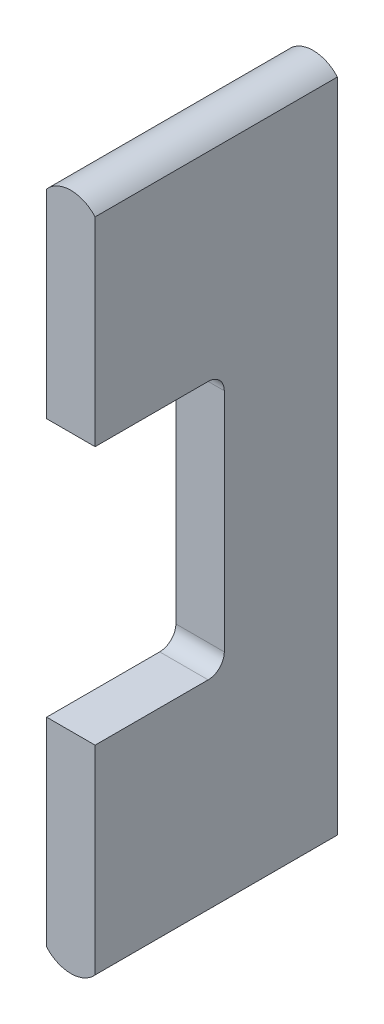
from build123d import *

# Parameters (mm, degrees)
BASE_EXTRUSION_DEPTH    = 15
ENL_V_MAT_EXTRU_1_DEPTH = 26.980762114


with BuildPart() as part:
    # Esquisse1 → Base-Extrusion (new body)
    with BuildSketch(Plane.XY):
        with BuildLine():
            Line((1.5, 20.322875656), (1.5, -20.322875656))
            ThreePointArc((1.5, -20.322875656), (0, -21), (-1.5, -20.322875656))
            Line((-1.5, -20.322875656), (-1.5, 20.322875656))
            ThreePointArc((-1.5, 20.322875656), (0, 21), (1.5, 20.322875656))
        make_face()
    extrude(amount=BASE_EXTRUSION_DEPTH)

    # Esquisse2 → Enl_v. mat.-Extru.1 (cut, through all)
    with BuildSketch(Plane(origin=(1.5, 0, 0), x_dir=(0, 0, -1), z_dir=(1, 0, 0))):
        with BuildLine():
            Line((-15, -8), (-15, 8))
            Line((-15, 8), (-8, 8))
            ThreePointArc((-8, 8), (-7.292893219, 7.707106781), (-7, 7))
            Line((-7, 7), (-7, -7))
            ThreePointArc((-7, -7), (-7.292893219, -7.707106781), (-8, -8))
            Line((-8, -8), (-15, -8))
        make_face()
    extrude(amount=-ENL_V_MAT_EXTRU_1_DEPTH, mode=Mode.SUBTRACT)


solid = part.part
